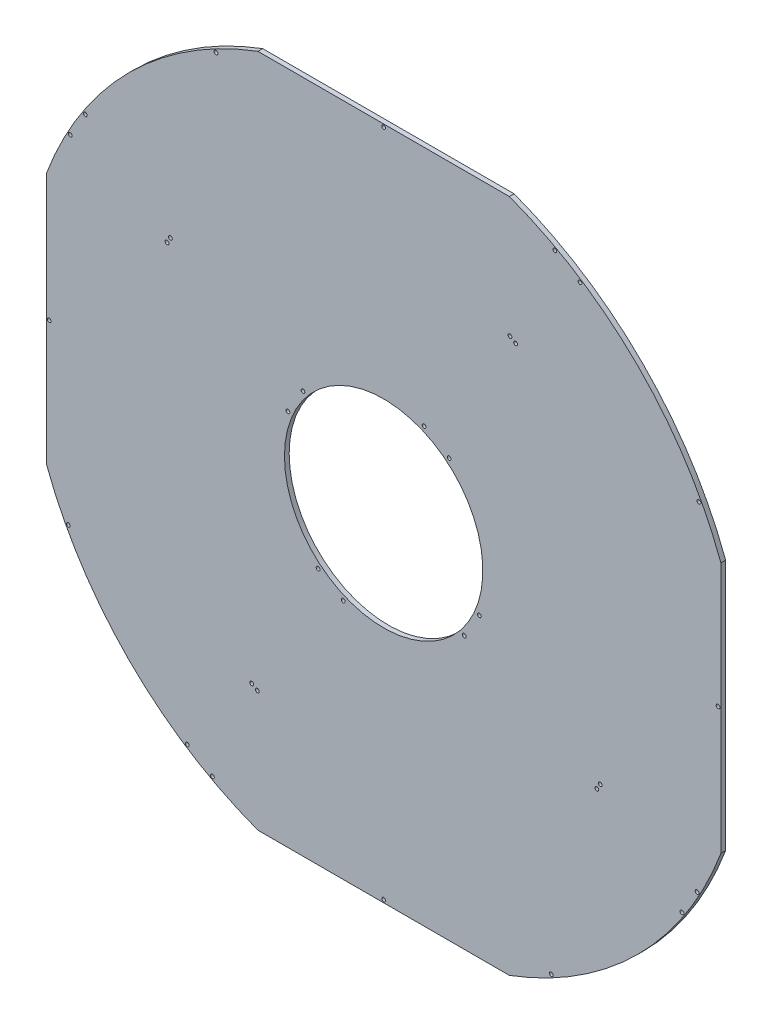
from build123d import *

# Parameters (mm, degrees)
EXTRUDE1_DEPTH     = 5
SKETCH2_R          = 2
CUT_EXTRUDE2_DEPTH = 484.868763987
CIRPATTERN1_COUNT  = 4


with BuildPart() as part:
    # Sketch1 → Extrude1 (new body)
    with BuildSketch(Plane.XY):
        with BuildLine():
            Line((133.086438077, 357), (-133.086438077, 357))
            ThreePointArc((-133.086438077, 357), (-243.485660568, 293.04561607), (-326.580741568, 196.229506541))
            Line((-326.580741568, 196.229506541), (-90.002566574, 54.078997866))
            ThreePointArc((-90.002566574, 54.078997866), (-25.401799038, 101.881051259), (54.078997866, 90.002566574))
            Line((54.078997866, 90.002566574), (196.229506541, 326.580741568))
            ThreePointArc((196.229506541, 326.580741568), (165.358944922, 343.245421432), (133.086438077, 357))
        make_face()
    extrude1 = extrude(amount=EXTRUDE1_DEPTH)

    # Sketch2 → Cut-Extrude2 (cut, through all)
    with BuildSketch(Plane.XY.offset(5)):
        with Locations((-315.753634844, 207.806742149)):
            Circle(SKETCH2_R)
        with Locations((-177.460250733, 333.754190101)):
            Circle(SKETCH2_R)
        with Locations((-85.364554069, 69.375016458)):
            Circle(SKETCH2_R)
        with Locations((0, 354)):
            Circle(SKETCH2_R)
        with Locations((42.802830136, 101.330734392)):
            Circle(SKETCH2_R)
        with Locations((181.234555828, 331.719815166)):
            Circle(SKETCH2_R)
        with Locations((133.694585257, 229.300769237)):
            Circle(SKETCH2_R)
        with Locations((-225.695502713, 139.694756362)):
            Circle(SKETCH2_R)
    cut_extrude2 = extrude(amount=-CUT_EXTRUDE2_DEPTH, mode=Mode.SUBTRACT)

    # CirPattern1: Extrude1, Cut-Extrude2 ×4 about axis
    cirpattern1_axis = Axis((0, 0, 0), (0, 0, 1))
    add([extrude1.rotate(cirpattern1_axis, i * 360 / CIRPATTERN1_COUNT) for i in range(1, CIRPATTERN1_COUNT)])
    add([cut_extrude2.rotate(cirpattern1_axis, i * 360 / CIRPATTERN1_COUNT) for i in range(1, CIRPATTERN1_COUNT)], mode=Mode.SUBTRACT)


solid = part.part
